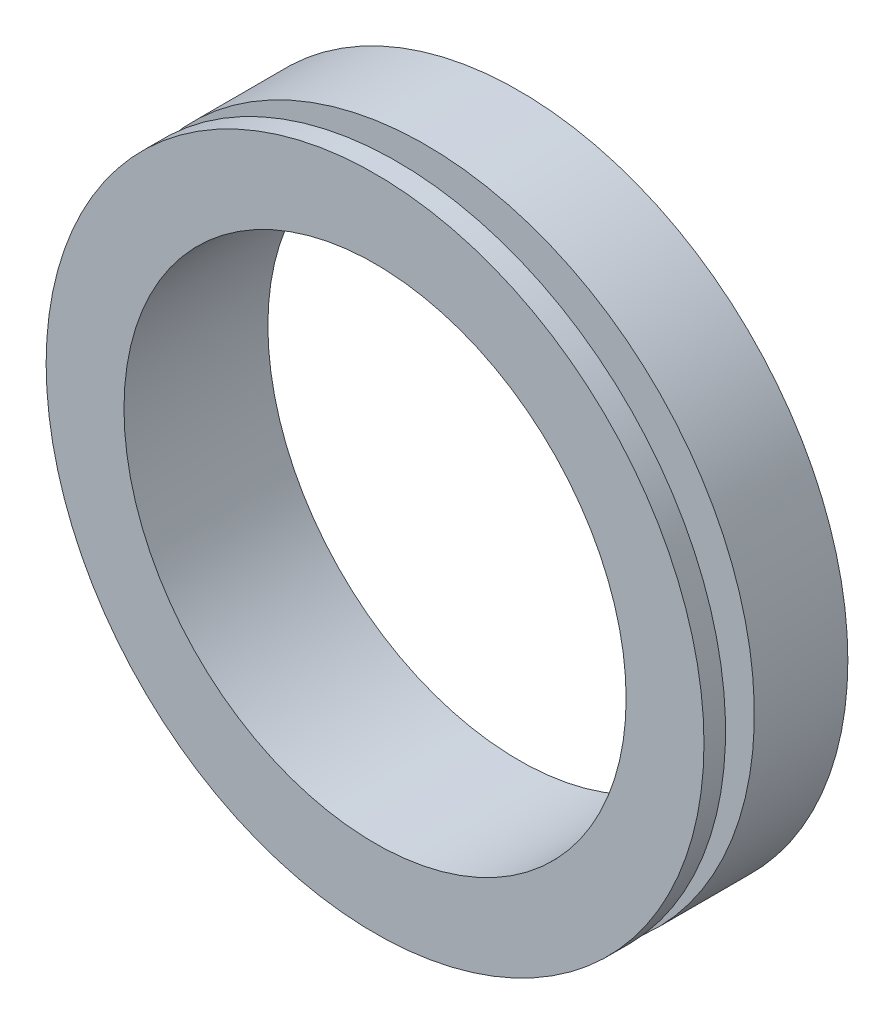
ISO-10303-21;
HEADER;
FILE_DESCRIPTION(('STEP AP214'),'2;1');
FILE_NAME('part.step','',(''),(''),'','','');
FILE_SCHEMA(('AUTOMOTIVE_DESIGN { 1 0 10303 214 1 1 1 1 }'));
ENDSEC;
DATA;
#1=APPLICATION_CONTEXT('core data for automotive mechanical design processes');
#2=APPLICATION_PROTOCOL_DEFINITION('international standard','automotive_design',2000,#1);
#3=PRODUCT_CONTEXT('',#1,'mechanical');
#4=PRODUCT('Part','Part','',(#3));
#5=PRODUCT_RELATED_PRODUCT_CATEGORY('part','',(#4));
#6=PRODUCT_DEFINITION_FORMATION('','',#4);
#7=PRODUCT_DEFINITION_CONTEXT('part definition',#1,'design');
#8=PRODUCT_DEFINITION('design','',#6,#7);
#9=PRODUCT_DEFINITION_SHAPE('','',#8);
#10=(LENGTH_UNIT() NAMED_UNIT(*) SI_UNIT(.MILLI.,.METRE.));
#11=(NAMED_UNIT(*) PLANE_ANGLE_UNIT() SI_UNIT($,.RADIAN.));
#12=(NAMED_UNIT(*) SI_UNIT($,.STERADIAN.) SOLID_ANGLE_UNIT());
#13=UNCERTAINTY_MEASURE_WITH_UNIT(LENGTH_MEASURE(1.E-05),#10,'distance_accuracy_value','');
#14=(GEOMETRIC_REPRESENTATION_CONTEXT(3) GLOBAL_UNCERTAINTY_ASSIGNED_CONTEXT((#13)) GLOBAL_UNIT_ASSIGNED_CONTEXT((#10,
#11,#12)) REPRESENTATION_CONTEXT('',''));
#15=CARTESIAN_POINT('',(0.,0.,0.));
#16=DIRECTION('',(0.,0.,1.));
#17=DIRECTION('',(1.,0.,0.));
#18=AXIS2_PLACEMENT_3D('',#15,#16,#17);
#19=CARTESIAN_POINT('',(0.,0.,5.));
#20=DIRECTION('',(0.,0.,-1.));
#21=DIRECTION('',(-1.,0.,0.));
#22=AXIS2_PLACEMENT_3D('',#19,#20,#21);
#23=CYLINDRICAL_SURFACE('',#22,11.43);
#24=CARTESIAN_POINT('',(0.,0.,5.));
#25=DIRECTION('',(0.,0.,1.));
#26=DIRECTION('',(1.,0.,0.));
#27=AXIS2_PLACEMENT_3D('',#24,#25,#26);
#28=CIRCLE('',#27,11.43);
#29=CARTESIAN_POINT('',(11.43,0.,5.));
#30=VERTEX_POINT('',#29);
#31=EDGE_CURVE('E10',#30,#30,#28,.T.);
#32=ORIENTED_EDGE('',*,*,#31,.F.);
#33=EDGE_LOOP('',(#32));
#34=FACE_BOUND('',#33,.T.);
#35=CARTESIAN_POINT('',(0.,0.,4.25));
#36=DIRECTION('',(0.,0.,-1.));
#37=DIRECTION('',(-1.,0.,0.));
#38=AXIS2_PLACEMENT_3D('',#35,#36,#37);
#39=CIRCLE('',#38,11.43);
#40=CARTESIAN_POINT('',(-11.43,0.,4.25));
#41=VERTEX_POINT('',#40);
#42=EDGE_CURVE('E50',#41,#41,#39,.T.);
#43=ORIENTED_EDGE('',*,*,#42,.F.);
#44=EDGE_LOOP('',(#43));
#45=FACE_BOUND('',#44,.T.);
#46=ADVANCED_FACE('F30',(#34,#45),#23,.T.);
#47=CARTESIAN_POINT('',(0.,0.,0.));
#48=DIRECTION('',(0.,0.,1.));
#49=DIRECTION('',(1.,0.,0.));
#50=AXIS2_PLACEMENT_3D('',#47,#48,#49);
#51=CIRCLE('',#50,11.43);
#52=CARTESIAN_POINT('',(11.43,0.,0.));
#53=VERTEX_POINT('',#52);
#54=EDGE_CURVE('E33',#53,#53,#51,.T.);
#55=ORIENTED_EDGE('',*,*,#54,.T.);
#56=EDGE_LOOP('',(#55));
#57=FACE_BOUND('',#56,.T.);
#58=CARTESIAN_POINT('',(0.,0.,3.25));
#59=DIRECTION('',(0.,0.,-1.));
#60=DIRECTION('',(-1.,0.,0.));
#61=AXIS2_PLACEMENT_3D('',#58,#59,#60);
#62=CIRCLE('',#61,11.43);
#63=CARTESIAN_POINT('',(-11.43,0.,3.25));
#64=VERTEX_POINT('',#63);
#65=EDGE_CURVE('E53',#64,#64,#62,.T.);
#66=ORIENTED_EDGE('',*,*,#65,.T.);
#67=EDGE_LOOP('',(#66));
#68=FACE_BOUND('',#67,.T.);
#69=ADVANCED_FACE('F79',(#57,#68),#23,.T.);
#70=CARTESIAN_POINT('',(0.,0.,5.));
#71=DIRECTION('',(0.,0.,1.));
#72=DIRECTION('',(1.,0.,0.));
#73=AXIS2_PLACEMENT_3D('',#70,#71,#72);
#74=PLANE('',#73);
#75=ORIENTED_EDGE('',*,*,#31,.T.);
#76=EDGE_LOOP('',(#75));
#77=FACE_BOUND('',#76,.T.);
#78=CARTESIAN_POINT('',(0.,0.,5.));
#79=DIRECTION('',(0.,0.,1.));
#80=DIRECTION('',(1.,0.,0.));
#81=AXIS2_PLACEMENT_3D('',#78,#79,#80);
#82=CIRCLE('',#81,8.7249);
#83=CARTESIAN_POINT('',(8.7249,0.,5.));
#84=VERTEX_POINT('',#83);
#85=EDGE_CURVE('E40',#84,#84,#82,.T.);
#86=ORIENTED_EDGE('',*,*,#85,.F.);
#87=EDGE_LOOP('',(#86));
#88=FACE_BOUND('',#87,.T.);
#89=ADVANCED_FACE('F84',(#77,#88),#74,.T.);
#90=CARTESIAN_POINT('',(0.,0.,0.));
#91=DIRECTION('',(0.,0.,1.));
#92=DIRECTION('',(1.,0.,0.));
#93=AXIS2_PLACEMENT_3D('',#90,#91,#92);
#94=PLANE('',#93);
#95=ORIENTED_EDGE('',*,*,#54,.F.);
#96=EDGE_LOOP('',(#95));
#97=FACE_BOUND('',#96,.T.);
#98=CARTESIAN_POINT('',(0.,0.,0.));
#99=DIRECTION('',(0.,0.,1.));
#100=DIRECTION('',(1.,0.,0.));
#101=AXIS2_PLACEMENT_3D('',#98,#99,#100);
#102=CIRCLE('',#101,8.7249);
#103=CARTESIAN_POINT('',(8.7249,0.,0.));
#104=VERTEX_POINT('',#103);
#105=EDGE_CURVE('E42',#104,#104,#102,.T.);
#106=ORIENTED_EDGE('',*,*,#105,.T.);
#107=EDGE_LOOP('',(#106));
#108=FACE_BOUND('',#107,.T.);
#109=ADVANCED_FACE('F75',(#97,#108),#94,.F.);
#110=CARTESIAN_POINT('',(0.,0.,5.));
#111=DIRECTION('',(0.,0.,-1.));
#112=DIRECTION('',(-1.,0.,0.));
#113=AXIS2_PLACEMENT_3D('',#110,#111,#112);
#114=CYLINDRICAL_SURFACE('',#113,8.7249);
#115=ORIENTED_EDGE('',*,*,#85,.T.);
#116=EDGE_LOOP('',(#115));
#117=FACE_BOUND('',#116,.T.);
#118=ORIENTED_EDGE('',*,*,#105,.F.);
#119=EDGE_LOOP('',(#118));
#120=FACE_BOUND('',#119,.T.);
#121=ADVANCED_FACE('F66',(#117,#120),#114,.F.);
#122=CARTESIAN_POINT('',(0.,0.,-2.18977762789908));
#123=DIRECTION('',(0.,0.,-1.));
#124=DIRECTION('',(-1.,0.,0.));
#125=AXIS2_PLACEMENT_3D('',#122,#123,#124);
#126=CYLINDRICAL_SURFACE('',#125,9.93);
#127=CARTESIAN_POINT('',(0.,0.,4.25));
#128=DIRECTION('',(0.,0.,-1.));
#129=DIRECTION('',(-1.,0.,0.));
#130=AXIS2_PLACEMENT_3D('',#127,#128,#129);
#131=CIRCLE('',#130,9.93);
#132=CARTESIAN_POINT('',(-9.93,0.,4.25));
#133=VERTEX_POINT('',#132);
#134=EDGE_CURVE('E45',#133,#133,#131,.T.);
#135=ORIENTED_EDGE('',*,*,#134,.T.);
#136=EDGE_LOOP('',(#135));
#137=FACE_BOUND('',#136,.T.);
#138=CARTESIAN_POINT('',(0.,0.,3.25));
#139=DIRECTION('',(0.,0.,-1.));
#140=DIRECTION('',(-1.,0.,0.));
#141=AXIS2_PLACEMENT_3D('',#138,#139,#140);
#142=CIRCLE('',#141,9.93);
#143=CARTESIAN_POINT('',(-9.93,0.,3.25));
#144=VERTEX_POINT('',#143);
#145=EDGE_CURVE('E56',#144,#144,#142,.T.);
#146=ORIENTED_EDGE('',*,*,#145,.F.);
#147=EDGE_LOOP('',(#146));
#148=FACE_BOUND('',#147,.T.);
#149=ADVANCED_FACE('F63',(#137,#148),#126,.T.);
#150=CARTESIAN_POINT('',(9.93,0.,4.25));
#151=DIRECTION('',(0.,0.,-1.));
#152=DIRECTION('',(-1.,0.,0.));
#153=AXIS2_PLACEMENT_3D('',#150,#151,#152);
#154=PLANE('',#153);
#155=ORIENTED_EDGE('',*,*,#42,.T.);
#156=EDGE_LOOP('',(#155));
#157=FACE_BOUND('',#156,.T.);
#158=ORIENTED_EDGE('',*,*,#134,.F.);
#159=EDGE_LOOP('',(#158));
#160=FACE_BOUND('',#159,.T.);
#161=ADVANCED_FACE('F65',(#157,#160),#154,.T.);
#162=CARTESIAN_POINT('',(9.93,0.,3.25));
#163=DIRECTION('',(0.,0.,1.));
#164=DIRECTION('',(1.,0.,0.));
#165=AXIS2_PLACEMENT_3D('',#162,#163,#164);
#166=PLANE('',#165);
#167=ORIENTED_EDGE('',*,*,#145,.T.);
#168=EDGE_LOOP('',(#167));
#169=FACE_BOUND('',#168,.T.);
#170=ORIENTED_EDGE('',*,*,#65,.F.);
#171=EDGE_LOOP('',(#170));
#172=FACE_BOUND('',#171,.T.);
#173=ADVANCED_FACE('F60',(#169,#172),#166,.T.);
#174=CLOSED_SHELL('',(#46,#69,#89,#109,#121,#149,#161,#173));
#175=MANIFOLD_SOLID_BREP('B2',#174);
#176=ADVANCED_BREP_SHAPE_REPRESENTATION('',(#18,#175),#14);
#177=SHAPE_DEFINITION_REPRESENTATION(#9,#176);
ENDSEC;
END-ISO-10303-21;
